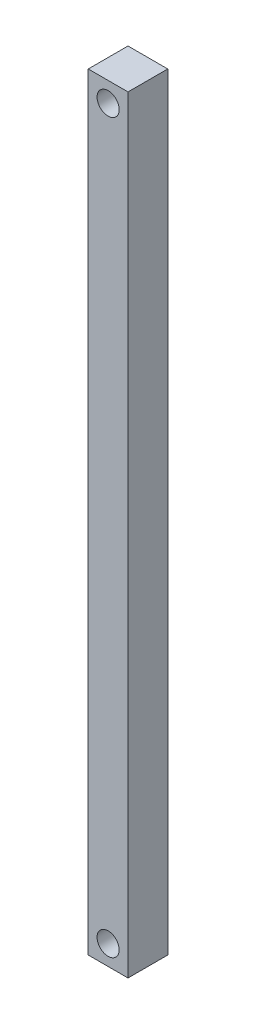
from build123d import *

# Parameters (mm, degrees)
SKETCH1_W           = 18.7
SKETCH1_H           = 361
SKETCH1_R           = 5.2
BOSS_EXTRUDE1_DEPTH = 18.7


with BuildPart() as part:
    # Sketch1 → Boss-Extrude1 (new body)
    with BuildSketch(Plane.XY):
        with Locations((5.58034328, 180.5)):
            Rectangle(SKETCH1_W, SKETCH1_H)
        with Locations((5.58034328, 351.65)):
            Circle(SKETCH1_R, mode=Mode.SUBTRACT)
        with Locations((5.58034328, 9.35)):
            Circle(SKETCH1_R, mode=Mode.SUBTRACT)
    extrude(amount=BOSS_EXTRUDE1_DEPTH)


solid = part.part
